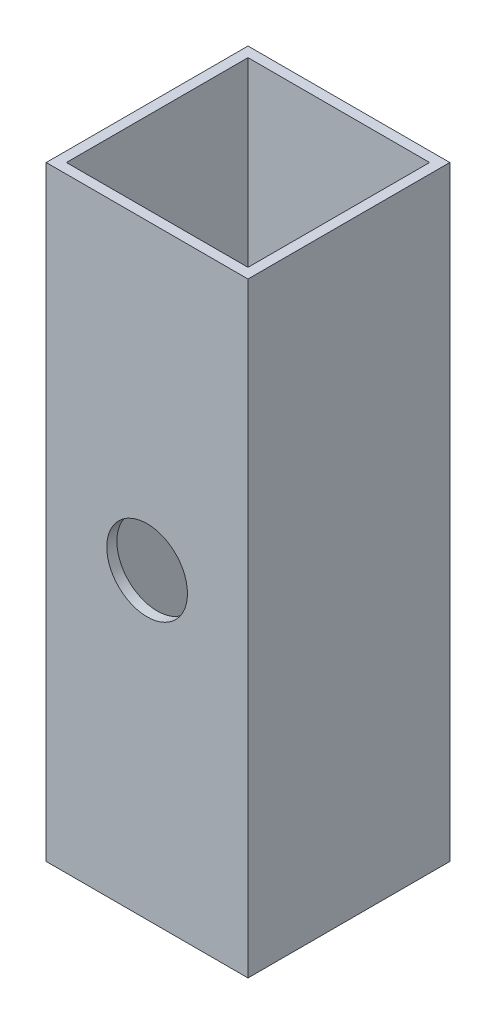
from build123d import *

# Parameters (mm, degrees)
SKETCH1_W           = 50
SKETCH1_H           = 50
BOSS_EXTRUDE1_DEPTH = 150
SHELL1_T            = -2.5
SKETCH2_R           = 10
CUT_EXTRUDE1_DEPTH  = 161.078105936


with BuildPart() as part:
    # Sketch1 → Boss-Extrude1 (new body)
    with BuildSketch(Plane(origin=(0, 0, 0), x_dir=(1, 0, 0), z_dir=(0, 1, 0))):
        Rectangle(SKETCH1_W, SKETCH1_H)
    extrude(amount=BOSS_EXTRUDE1_DEPTH)

    # Shell1
    shell1_openings = [part.faces().sort_by_distance(p)[0] for p in [
        (0, 150, 0),
        (0, 0, 0),
    ]]
    offset(amount=SHELL1_T, openings=shell1_openings, kind=Kind.INTERSECTION)

    # Sketch2 → Cut-Extrude1 (cut, through all)
    with BuildSketch(Plane.XY.offset(25)):
        with Locations((0, 75)):
            Circle(SKETCH2_R)
    extrude(amount=-CUT_EXTRUDE1_DEPTH, mode=Mode.SUBTRACT)


solid = part.part
